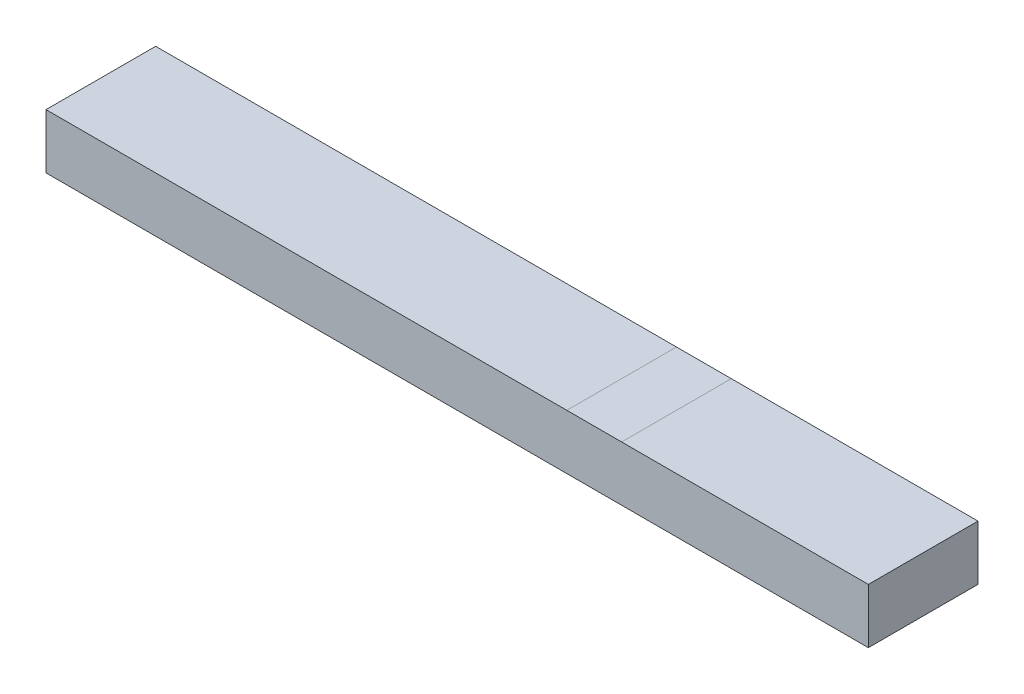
from build123d import *

# Parameters (mm, degrees)
SKETCH1_W           = 100
SKETCH1_H           = 50
BOSS_EXTRUDE1_DEPTH = 750


with BuildPart() as part:
    # Sketch1 → Boss-Extrude1 (new body)
    with BuildSketch(Plane(origin=(0, 0, 0), x_dir=(0, 0, -1), z_dir=(1, 0, 0))):
        Rectangle(SKETCH1_W, SKETCH1_H)
    extrude(amount=BOSS_EXTRUDE1_DEPTH)


solid = part.part
